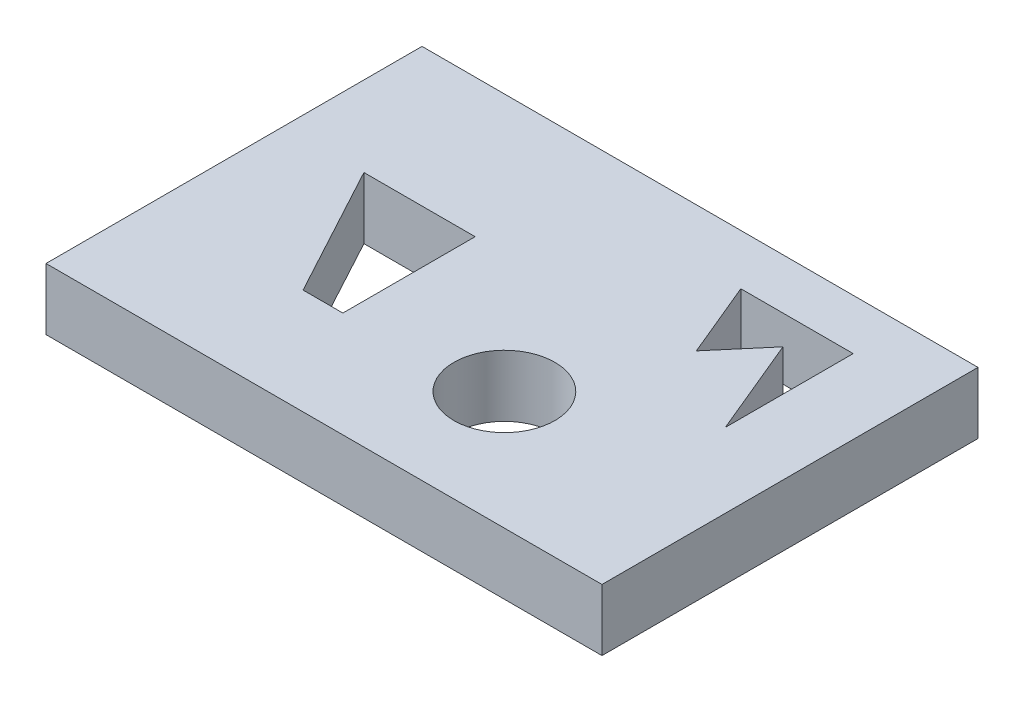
ISO-10303-21;
HEADER;
FILE_DESCRIPTION(('STEP AP214'),'2;1');
FILE_NAME('part.step','',(''),(''),'','','');
FILE_SCHEMA(('AUTOMOTIVE_DESIGN { 1 0 10303 214 1 1 1 1 }'));
ENDSEC;
DATA;
#1=APPLICATION_CONTEXT('core data for automotive mechanical design processes');
#2=APPLICATION_PROTOCOL_DEFINITION('international standard','automotive_design',2000,#1);
#3=PRODUCT_CONTEXT('',#1,'mechanical');
#4=PRODUCT('Part','Part','',(#3));
#5=PRODUCT_RELATED_PRODUCT_CATEGORY('part','',(#4));
#6=PRODUCT_DEFINITION_FORMATION('','',#4);
#7=PRODUCT_DEFINITION_CONTEXT('part definition',#1,'design');
#8=PRODUCT_DEFINITION('design','',#6,#7);
#9=PRODUCT_DEFINITION_SHAPE('','',#8);
#10=(LENGTH_UNIT() NAMED_UNIT(*) SI_UNIT(.MILLI.,.METRE.));
#11=(NAMED_UNIT(*) PLANE_ANGLE_UNIT() SI_UNIT($,.RADIAN.));
#12=(NAMED_UNIT(*) SI_UNIT($,.STERADIAN.) SOLID_ANGLE_UNIT());
#13=UNCERTAINTY_MEASURE_WITH_UNIT(LENGTH_MEASURE(1.E-05),#10,'distance_accuracy_value','');
#14=(GEOMETRIC_REPRESENTATION_CONTEXT(3) GLOBAL_UNCERTAINTY_ASSIGNED_CONTEXT((#13)) GLOBAL_UNIT_ASSIGNED_CONTEXT((#10,
#11,#12)) REPRESENTATION_CONTEXT('',''));
#15=CARTESIAN_POINT('',(0.,0.,0.));
#16=DIRECTION('',(0.,0.,1.));
#17=DIRECTION('',(1.,0.,0.));
#18=AXIS2_PLACEMENT_3D('',#15,#16,#17);
#19=CARTESIAN_POINT('',(-105.477577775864,-24.384,-74.1902678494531));
#20=DIRECTION('',(-1.,0.,0.));
#21=DIRECTION('',(0.,0.,1.));
#22=AXIS2_PLACEMENT_3D('',#19,#20,#21);
#23=PLANE('',#22);
#24=DIRECTION('',(0.,0.,1.));
#25=VECTOR('',#24,1.);
#26=CARTESIAN_POINT('',(-105.477577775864,0.,-74.1902678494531));
#27=LINE('',#26,#25);
#28=CARTESIAN_POINT('',(-105.477577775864,0.,-74.1902678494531));
#29=VERTEX_POINT('',#28);
#30=CARTESIAN_POINT('',(-105.477577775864,0.,74.5649661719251));
#31=VERTEX_POINT('',#30);
#32=EDGE_CURVE('E190',#29,#31,#27,.T.);
#33=ORIENTED_EDGE('',*,*,#32,.F.);
#34=DIRECTION('',(0.,1.,0.));
#35=VECTOR('',#34,1.);
#36=CARTESIAN_POINT('',(-105.477577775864,-24.384,-74.1902678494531));
#37=LINE('',#36,#35);
#38=CARTESIAN_POINT('',(-105.477577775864,-24.384,-74.1902678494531));
#39=VERTEX_POINT('',#38);
#40=EDGE_CURVE('E11',#39,#29,#37,.T.);
#41=ORIENTED_EDGE('',*,*,#40,.F.);
#42=DIRECTION('',(0.,0.,1.));
#43=VECTOR('',#42,1.);
#44=CARTESIAN_POINT('',(-105.477577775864,-24.384,-74.1902678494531));
#45=LINE('',#44,#43);
#46=CARTESIAN_POINT('',(-105.477577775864,-24.384,74.5649661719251));
#47=VERTEX_POINT('',#46);
#48=EDGE_CURVE('E210',#39,#47,#45,.T.);
#49=ORIENTED_EDGE('',*,*,#48,.T.);
#50=DIRECTION('',(0.,1.,0.));
#51=VECTOR('',#50,1.);
#52=CARTESIAN_POINT('',(-105.477577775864,-24.384,74.5649661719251));
#53=LINE('',#52,#51);
#54=EDGE_CURVE('E30',#47,#31,#53,.T.);
#55=ORIENTED_EDGE('',*,*,#54,.T.);
#56=EDGE_LOOP('',(#33,#41,#49,#55));
#57=FACE_BOUND('',#56,.T.);
#58=ADVANCED_FACE('F27',(#57),#23,.T.);
#59=CARTESIAN_POINT('',(-105.477577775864,-24.384,-74.1902678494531));
#60=DIRECTION('',(0.,0.,-1.));
#61=DIRECTION('',(-1.,0.,0.));
#62=AXIS2_PLACEMENT_3D('',#59,#60,#61);
#63=PLANE('',#62);
#64=DIRECTION('',(-1.,0.,0.));
#65=VECTOR('',#64,1.);
#66=CARTESIAN_POINT('',(-105.477577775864,0.,-74.1902678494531));
#67=LINE('',#66,#65);
#68=CARTESIAN_POINT('',(114.470337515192,0.,-74.1902678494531));
#69=VERTEX_POINT('',#68);
#70=EDGE_CURVE('E207',#69,#29,#67,.T.);
#71=ORIENTED_EDGE('',*,*,#70,.F.);
#72=DIRECTION('',(0.,1.,0.));
#73=VECTOR('',#72,1.);
#74=CARTESIAN_POINT('',(114.470337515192,-24.384,-74.1902678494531));
#75=LINE('',#74,#73);
#76=CARTESIAN_POINT('',(114.470337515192,-24.384,-74.1902678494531));
#77=VERTEX_POINT('',#76);
#78=EDGE_CURVE('E35',#77,#69,#75,.T.);
#79=ORIENTED_EDGE('',*,*,#78,.F.);
#80=DIRECTION('',(-1.,0.,0.));
#81=VECTOR('',#80,1.);
#82=CARTESIAN_POINT('',(-105.477577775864,-24.384,-74.1902678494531));
#83=LINE('',#82,#81);
#84=EDGE_CURVE('E219',#77,#39,#83,.T.);
#85=ORIENTED_EDGE('',*,*,#84,.T.);
#86=ORIENTED_EDGE('',*,*,#40,.T.);
#87=EDGE_LOOP('',(#71,#79,#85,#86));
#88=FACE_BOUND('',#87,.T.);
#89=ADVANCED_FACE('F234',(#88),#63,.T.);
#90=CARTESIAN_POINT('',(114.470337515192,-24.384,-74.1902678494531));
#91=DIRECTION('',(1.,0.,0.));
#92=DIRECTION('',(0.,0.,-1.));
#93=AXIS2_PLACEMENT_3D('',#90,#91,#92);
#94=PLANE('',#93);
#95=DIRECTION('',(0.,0.,-1.));
#96=VECTOR('',#95,1.);
#97=CARTESIAN_POINT('',(114.470337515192,0.,-74.1902678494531));
#98=LINE('',#97,#96);
#99=CARTESIAN_POINT('',(114.470337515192,0.,74.5649661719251));
#100=VERTEX_POINT('',#99);
#101=EDGE_CURVE('E204',#100,#69,#98,.T.);
#102=ORIENTED_EDGE('',*,*,#101,.F.);
#103=DIRECTION('',(0.,1.,0.));
#104=VECTOR('',#103,1.);
#105=CARTESIAN_POINT('',(114.470337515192,-24.384,74.5649661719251));
#106=LINE('',#105,#104);
#107=CARTESIAN_POINT('',(114.470337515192,-24.384,74.5649661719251));
#108=VERTEX_POINT('',#107);
#109=EDGE_CURVE('E222',#108,#100,#106,.T.);
#110=ORIENTED_EDGE('',*,*,#109,.F.);
#111=DIRECTION('',(0.,0.,-1.));
#112=VECTOR('',#111,1.);
#113=CARTESIAN_POINT('',(114.470337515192,-24.384,-74.1902678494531));
#114=LINE('',#113,#112);
#115=EDGE_CURVE('E216',#108,#77,#114,.T.);
#116=ORIENTED_EDGE('',*,*,#115,.T.);
#117=ORIENTED_EDGE('',*,*,#78,.T.);
#118=EDGE_LOOP('',(#102,#110,#116,#117));
#119=FACE_BOUND('',#118,.T.);
#120=ADVANCED_FACE('F240',(#119),#94,.T.);
#121=CARTESIAN_POINT('',(-105.477577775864,-24.384,74.5649661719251));
#122=DIRECTION('',(0.,0.,1.));
#123=DIRECTION('',(1.,0.,0.));
#124=AXIS2_PLACEMENT_3D('',#121,#122,#123);
#125=PLANE('',#124);
#126=DIRECTION('',(1.,0.,0.));
#127=VECTOR('',#126,1.);
#128=CARTESIAN_POINT('',(-105.477577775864,0.,74.5649661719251));
#129=LINE('',#128,#127);
#130=EDGE_CURVE('E201',#31,#100,#129,.T.);
#131=ORIENTED_EDGE('',*,*,#130,.F.);
#132=ORIENTED_EDGE('',*,*,#54,.F.);
#133=DIRECTION('',(1.,0.,0.));
#134=VECTOR('',#133,1.);
#135=CARTESIAN_POINT('',(-105.477577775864,-24.384,74.5649661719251));
#136=LINE('',#135,#134);
#137=EDGE_CURVE('E213',#47,#108,#136,.T.);
#138=ORIENTED_EDGE('',*,*,#137,.T.);
#139=ORIENTED_EDGE('',*,*,#109,.T.);
#140=EDGE_LOOP('',(#131,#132,#138,#139));
#141=FACE_BOUND('',#140,.T.);
#142=ADVANCED_FACE('F230',(#141),#125,.T.);
#143=CARTESIAN_POINT('',(-105.477577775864,-24.384,74.5649661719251));
#144=DIRECTION('',(0.,1.,0.));
#145=DIRECTION('',(0.,0.,1.));
#146=AXIS2_PLACEMENT_3D('',#143,#144,#145);
#147=PLANE('',#146);
#148=CARTESIAN_POINT('',(29.0381715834,-24.384,27.7389832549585));
#149=DIRECTION('',(0.,1.,0.));
#150=DIRECTION('',(0.,0.,1.));
#151=AXIS2_PLACEMENT_3D('',#148,#149,#150);
#152=CIRCLE('',#151,19.9757724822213);
#153=CARTESIAN_POINT('',(29.0381715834,-24.384,47.7147557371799));
#154=VERTEX_POINT('',#153);
#155=EDGE_CURVE('E355',#154,#154,#152,.T.);
#156=ORIENTED_EDGE('',*,*,#155,.T.);
#157=EDGE_LOOP('',(#156));
#158=FACE_BOUND('',#157,.T.);
#159=DIRECTION('',(0.,0.,-1.));
#160=VECTOR('',#159,1.);
#161=CARTESIAN_POINT('',(-29.7695179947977,-24.384,-19.4923894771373));
#162=LINE('',#161,#160);
#163=CARTESIAN_POINT('',(-29.7695179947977,-24.384,32.8325626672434));
#164=VERTEX_POINT('',#163);
#165=CARTESIAN_POINT('',(-29.7695179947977,-24.384,-19.4923894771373));
#166=VERTEX_POINT('',#165);
#167=EDGE_CURVE('E151',#164,#166,#162,.T.);
#168=ORIENTED_EDGE('',*,*,#167,.T.);
#169=DIRECTION('',(-1.,0.,0.));
#170=VECTOR('',#169,1.);
#171=CARTESIAN_POINT('',(-73.759522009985,-24.384,-19.4923894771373));
#172=LINE('',#171,#170);
#173=CARTESIAN_POINT('',(-73.759522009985,-24.384,-19.4923894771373));
#174=VERTEX_POINT('',#173);
#175=EDGE_CURVE('E142',#166,#174,#172,.T.);
#176=ORIENTED_EDGE('',*,*,#175,.T.);
#177=DIRECTION('',(0.475028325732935,0.,0.879970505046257));
#178=VECTOR('',#177,1.);
#179=CARTESIAN_POINT('',(-45.5133089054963,-24.384,32.8325626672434));
#180=LINE('',#179,#178);
#181=CARTESIAN_POINT('',(-45.5133089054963,-24.384,32.8325626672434));
#182=VERTEX_POINT('',#181);
#183=EDGE_CURVE('E148',#174,#182,#180,.T.);
#184=ORIENTED_EDGE('',*,*,#183,.T.);
#185=DIRECTION('',(1.,0.,0.));
#186=VECTOR('',#185,1.);
#187=CARTESIAN_POINT('',(-29.7695179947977,-24.384,32.8325626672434));
#188=LINE('',#187,#186);
#189=EDGE_CURVE('E43',#182,#164,#188,.T.);
#190=ORIENTED_EDGE('',*,*,#189,.T.);
#191=EDGE_LOOP('',(#168,#176,#184,#190));
#192=FACE_BOUND('',#191,.T.);
#193=DIRECTION('',(0.383606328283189,0.,0.923496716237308));
#194=VECTOR('',#193,1.);
#195=CARTESIAN_POINT('',(68.8607015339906,-24.384,-42.6450231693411));
#196=LINE('',#195,#194);
#197=CARTESIAN_POINT('',(68.8607015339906,-24.384,-42.6450231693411));
#198=VERTEX_POINT('',#197);
#199=CARTESIAN_POINT('',(85.0675451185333,-24.384,-3.62854787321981));
#200=VERTEX_POINT('',#199);
#201=EDGE_CURVE('E184',#198,#200,#196,.T.);
#202=ORIENTED_EDGE('',*,*,#201,.T.);
#203=DIRECTION('',(0.,0.,-1.));
#204=VECTOR('',#203,1.);
#205=CARTESIAN_POINT('',(85.0675451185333,-24.384,-3.62854787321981));
#206=LINE('',#205,#204);
#207=CARTESIAN_POINT('',(85.0675451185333,-24.384,-54.2213400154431));
#208=VERTEX_POINT('',#207);
#209=EDGE_CURVE('E172',#200,#208,#206,.T.);
#210=ORIENTED_EDGE('',*,*,#209,.T.);
#211=DIRECTION('',(-1.,0.,0.));
#212=VECTOR('',#211,1.);
#213=CARTESIAN_POINT('',(85.0675451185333,-24.384,-54.2213400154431));
#214=LINE('',#213,#212);
#215=CARTESIAN_POINT('',(40.6144884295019,-24.384,-54.2213400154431));
#216=VERTEX_POINT('',#215);
#217=EDGE_CURVE('E175',#208,#216,#214,.T.);
#218=ORIENTED_EDGE('',*,*,#217,.T.);
#219=DIRECTION('',(0.383606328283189,0.,0.923496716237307));
#220=VECTOR('',#219,1.);
#221=CARTESIAN_POINT('',(40.6144884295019,-24.384,-54.2213400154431));
#222=LINE('',#221,#220);
#223=CARTESIAN_POINT('',(53.116910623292,-24.384,-24.1229162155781));
#224=VERTEX_POINT('',#223);
#225=EDGE_CURVE('E178',#216,#224,#222,.T.);
#226=ORIENTED_EDGE('',*,*,#225,.T.);
#227=DIRECTION('',(0.64764842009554,0.,-0.761939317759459));
#228=VECTOR('',#227,1.);
#229=CARTESIAN_POINT('',(53.116910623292,-24.384,-24.1229162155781));
#230=LINE('',#229,#228);
#231=EDGE_CURVE('E181',#224,#198,#230,.T.);
#232=ORIENTED_EDGE('',*,*,#231,.T.);
#233=EDGE_LOOP('',(#202,#210,#218,#226,#232));
#234=FACE_BOUND('',#233,.T.);
#235=ORIENTED_EDGE('',*,*,#48,.F.);
#236=ORIENTED_EDGE('',*,*,#84,.F.);
#237=ORIENTED_EDGE('',*,*,#115,.F.);
#238=ORIENTED_EDGE('',*,*,#137,.F.);
#239=EDGE_LOOP('',(#235,#236,#237,#238));
#240=FACE_BOUND('',#239,.T.);
#241=ADVANCED_FACE('F237',(#158,#192,#234,#240),#147,.F.);
#242=CARTESIAN_POINT('',(-105.477577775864,0.,74.5649661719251));
#243=DIRECTION('',(0.,1.,0.));
#244=DIRECTION('',(0.,0.,1.));
#245=AXIS2_PLACEMENT_3D('',#242,#243,#244);
#246=PLANE('',#245);
#247=CARTESIAN_POINT('',(29.0381715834,0.,27.7389832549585));
#248=DIRECTION('',(0.,1.,0.));
#249=DIRECTION('',(0.,0.,1.));
#250=AXIS2_PLACEMENT_3D('',#247,#248,#249);
#251=CIRCLE('',#250,19.9757724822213);
#252=CARTESIAN_POINT('',(29.0381715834,0.,47.7147557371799));
#253=VERTEX_POINT('',#252);
#254=EDGE_CURVE('E358',#253,#253,#251,.T.);
#255=ORIENTED_EDGE('',*,*,#254,.F.);
#256=EDGE_LOOP('',(#255));
#257=FACE_BOUND('',#256,.T.);
#258=DIRECTION('',(-1.,0.,0.));
#259=VECTOR('',#258,1.);
#260=CARTESIAN_POINT('',(-73.759522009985,0.,-19.4923894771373));
#261=LINE('',#260,#259);
#262=CARTESIAN_POINT('',(-29.7695179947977,0.,-19.4923894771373));
#263=VERTEX_POINT('',#262);
#264=CARTESIAN_POINT('',(-73.759522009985,0.,-19.4923894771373));
#265=VERTEX_POINT('',#264);
#266=EDGE_CURVE('E51',#263,#265,#261,.T.);
#267=ORIENTED_EDGE('',*,*,#266,.F.);
#268=DIRECTION('',(0.,0.,-1.));
#269=VECTOR('',#268,1.);
#270=CARTESIAN_POINT('',(-29.7695179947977,0.,-19.4923894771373));
#271=LINE('',#270,#269);
#272=CARTESIAN_POINT('',(-29.7695179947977,0.,32.8325626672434));
#273=VERTEX_POINT('',#272);
#274=EDGE_CURVE('E140',#273,#263,#271,.T.);
#275=ORIENTED_EDGE('',*,*,#274,.F.);
#276=DIRECTION('',(1.,0.,0.));
#277=VECTOR('',#276,1.);
#278=CARTESIAN_POINT('',(-29.7695179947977,0.,32.8325626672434));
#279=LINE('',#278,#277);
#280=CARTESIAN_POINT('',(-45.5133089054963,0.,32.8325626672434));
#281=VERTEX_POINT('',#280);
#282=EDGE_CURVE('E124',#281,#273,#279,.T.);
#283=ORIENTED_EDGE('',*,*,#282,.F.);
#284=DIRECTION('',(0.475028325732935,0.,0.879970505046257));
#285=VECTOR('',#284,1.);
#286=CARTESIAN_POINT('',(-45.5133089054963,0.,32.8325626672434));
#287=LINE('',#286,#285);
#288=EDGE_CURVE('E133',#265,#281,#287,.T.);
#289=ORIENTED_EDGE('',*,*,#288,.F.);
#290=EDGE_LOOP('',(#267,#275,#283,#289));
#291=FACE_BOUND('',#290,.T.);
#292=DIRECTION('',(0.,0.,-1.));
#293=VECTOR('',#292,1.);
#294=CARTESIAN_POINT('',(85.0675451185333,0.,-3.62854787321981));
#295=LINE('',#294,#293);
#296=CARTESIAN_POINT('',(85.0675451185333,0.,-3.62854787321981));
#297=VERTEX_POINT('',#296);
#298=CARTESIAN_POINT('',(85.0675451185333,0.,-54.2213400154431));
#299=VERTEX_POINT('',#298);
#300=EDGE_CURVE('E156',#297,#299,#295,.T.);
#301=ORIENTED_EDGE('',*,*,#300,.F.);
#302=DIRECTION('',(0.383606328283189,0.,0.923496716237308));
#303=VECTOR('',#302,1.);
#304=CARTESIAN_POINT('',(68.8607015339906,0.,-42.6450231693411));
#305=LINE('',#304,#303);
#306=CARTESIAN_POINT('',(68.8607015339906,0.,-42.6450231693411));
#307=VERTEX_POINT('',#306);
#308=EDGE_CURVE('E169',#307,#297,#305,.T.);
#309=ORIENTED_EDGE('',*,*,#308,.F.);
#310=DIRECTION('',(0.64764842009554,0.,-0.761939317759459));
#311=VECTOR('',#310,1.);
#312=CARTESIAN_POINT('',(53.116910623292,0.,-24.1229162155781));
#313=LINE('',#312,#311);
#314=CARTESIAN_POINT('',(53.116910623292,0.,-24.1229162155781));
#315=VERTEX_POINT('',#314);
#316=EDGE_CURVE('E166',#315,#307,#313,.T.);
#317=ORIENTED_EDGE('',*,*,#316,.F.);
#318=DIRECTION('',(0.383606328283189,0.,0.923496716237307));
#319=VECTOR('',#318,1.);
#320=CARTESIAN_POINT('',(40.6144884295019,0.,-54.2213400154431));
#321=LINE('',#320,#319);
#322=CARTESIAN_POINT('',(40.6144884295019,0.,-54.2213400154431));
#323=VERTEX_POINT('',#322);
#324=EDGE_CURVE('E163',#323,#315,#321,.T.);
#325=ORIENTED_EDGE('',*,*,#324,.F.);
#326=DIRECTION('',(-1.,0.,0.));
#327=VECTOR('',#326,1.);
#328=CARTESIAN_POINT('',(85.0675451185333,0.,-54.2213400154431));
#329=LINE('',#328,#327);
#330=EDGE_CURVE('E160',#299,#323,#329,.T.);
#331=ORIENTED_EDGE('',*,*,#330,.F.);
#332=EDGE_LOOP('',(#301,#309,#317,#325,#331));
#333=FACE_BOUND('',#332,.T.);
#334=ORIENTED_EDGE('',*,*,#32,.T.);
#335=ORIENTED_EDGE('',*,*,#130,.T.);
#336=ORIENTED_EDGE('',*,*,#101,.T.);
#337=ORIENTED_EDGE('',*,*,#70,.T.);
#338=EDGE_LOOP('',(#334,#335,#336,#337));
#339=FACE_BOUND('',#338,.T.);
#340=ADVANCED_FACE('F137',(#257,#291,#333,#339),#246,.T.);
#341=CARTESIAN_POINT('',(85.0675451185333,-24.384,-3.62854787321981));
#342=DIRECTION('',(1.,0.,0.));
#343=DIRECTION('',(0.,0.,-1.));
#344=AXIS2_PLACEMENT_3D('',#341,#342,#343);
#345=PLANE('',#344);
#346=ORIENTED_EDGE('',*,*,#300,.T.);
#347=DIRECTION('',(0.,1.,0.));
#348=VECTOR('',#347,1.);
#349=CARTESIAN_POINT('',(85.0675451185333,-24.384,-54.2213400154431));
#350=LINE('',#349,#348);
#351=EDGE_CURVE('E187',#208,#299,#350,.T.);
#352=ORIENTED_EDGE('',*,*,#351,.F.);
#353=ORIENTED_EDGE('',*,*,#209,.F.);
#354=DIRECTION('',(0.,1.,0.));
#355=VECTOR('',#354,1.);
#356=CARTESIAN_POINT('',(85.0675451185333,-24.384,-3.62854787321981));
#357=LINE('',#356,#355);
#358=EDGE_CURVE('E188',#200,#297,#357,.T.);
#359=ORIENTED_EDGE('',*,*,#358,.T.);
#360=EDGE_LOOP('',(#346,#352,#353,#359));
#361=FACE_BOUND('',#360,.T.);
#362=ADVANCED_FACE('F275',(#361),#345,.F.);
#363=CARTESIAN_POINT('',(68.8607015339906,-24.384,-42.6450231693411));
#364=DIRECTION('',(-0.923496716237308,0.,0.383606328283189));
#365=DIRECTION('',(0.383606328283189,0.,0.923496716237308));
#366=AXIS2_PLACEMENT_3D('',#363,#364,#365);
#367=PLANE('',#366);
#368=ORIENTED_EDGE('',*,*,#308,.T.);
#369=ORIENTED_EDGE('',*,*,#358,.F.);
#370=ORIENTED_EDGE('',*,*,#201,.F.);
#371=DIRECTION('',(0.,1.,0.));
#372=VECTOR('',#371,1.);
#373=CARTESIAN_POINT('',(68.8607015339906,-24.384,-42.6450231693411));
#374=LINE('',#373,#372);
#375=EDGE_CURVE('E191',#198,#307,#374,.T.);
#376=ORIENTED_EDGE('',*,*,#375,.T.);
#377=EDGE_LOOP('',(#368,#369,#370,#376));
#378=FACE_BOUND('',#377,.T.);
#379=ADVANCED_FACE('F283',(#378),#367,.F.);
#380=CARTESIAN_POINT('',(53.116910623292,-24.384,-24.1229162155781));
#381=DIRECTION('',(0.761939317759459,0.,0.64764842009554));
#382=DIRECTION('',(0.64764842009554,0.,-0.761939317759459));
#383=AXIS2_PLACEMENT_3D('',#380,#381,#382);
#384=PLANE('',#383);
#385=ORIENTED_EDGE('',*,*,#316,.T.);
#386=ORIENTED_EDGE('',*,*,#375,.F.);
#387=ORIENTED_EDGE('',*,*,#231,.F.);
#388=DIRECTION('',(0.,1.,0.));
#389=VECTOR('',#388,1.);
#390=CARTESIAN_POINT('',(53.116910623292,-24.384,-24.1229162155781));
#391=LINE('',#390,#389);
#392=EDGE_CURVE('E193',#224,#315,#391,.T.);
#393=ORIENTED_EDGE('',*,*,#392,.T.);
#394=EDGE_LOOP('',(#385,#386,#387,#393));
#395=FACE_BOUND('',#394,.T.);
#396=ADVANCED_FACE('F291',(#395),#384,.F.);
#397=CARTESIAN_POINT('',(40.6144884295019,-24.384,-54.2213400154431));
#398=DIRECTION('',(-0.923496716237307,0.,0.383606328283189));
#399=DIRECTION('',(0.383606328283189,0.,0.923496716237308));
#400=AXIS2_PLACEMENT_3D('',#397,#398,#399);
#401=PLANE('',#400);
#402=ORIENTED_EDGE('',*,*,#324,.T.);
#403=ORIENTED_EDGE('',*,*,#392,.F.);
#404=ORIENTED_EDGE('',*,*,#225,.F.);
#405=DIRECTION('',(0.,1.,0.));
#406=VECTOR('',#405,1.);
#407=CARTESIAN_POINT('',(40.6144884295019,-24.384,-54.2213400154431));
#408=LINE('',#407,#406);
#409=EDGE_CURVE('E195',#216,#323,#408,.T.);
#410=ORIENTED_EDGE('',*,*,#409,.T.);
#411=EDGE_LOOP('',(#402,#403,#404,#410));
#412=FACE_BOUND('',#411,.T.);
#413=ADVANCED_FACE('F299',(#412),#401,.F.);
#414=CARTESIAN_POINT('',(85.0675451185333,-24.384,-54.2213400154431));
#415=DIRECTION('',(0.,0.,-1.));
#416=DIRECTION('',(-1.,0.,0.));
#417=AXIS2_PLACEMENT_3D('',#414,#415,#416);
#418=PLANE('',#417);
#419=ORIENTED_EDGE('',*,*,#330,.T.);
#420=ORIENTED_EDGE('',*,*,#409,.F.);
#421=ORIENTED_EDGE('',*,*,#217,.F.);
#422=ORIENTED_EDGE('',*,*,#351,.T.);
#423=EDGE_LOOP('',(#419,#420,#421,#422));
#424=FACE_BOUND('',#423,.T.);
#425=ADVANCED_FACE('F307',(#424),#418,.F.);
#426=CARTESIAN_POINT('',(-73.759522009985,-24.384,-19.4923894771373));
#427=DIRECTION('',(0.,0.,-1.));
#428=DIRECTION('',(-1.,0.,0.));
#429=AXIS2_PLACEMENT_3D('',#426,#427,#428);
#430=PLANE('',#429);
#431=ORIENTED_EDGE('',*,*,#266,.T.);
#432=DIRECTION('',(0.,1.,0.));
#433=VECTOR('',#432,1.);
#434=CARTESIAN_POINT('',(-73.759522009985,-24.384,-19.4923894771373));
#435=LINE('',#434,#433);
#436=EDGE_CURVE('E130',#174,#265,#435,.T.);
#437=ORIENTED_EDGE('',*,*,#436,.F.);
#438=ORIENTED_EDGE('',*,*,#175,.F.);
#439=DIRECTION('',(0.,1.,0.));
#440=VECTOR('',#439,1.);
#441=CARTESIAN_POINT('',(-29.7695179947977,-24.384,-19.4923894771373));
#442=LINE('',#441,#440);
#443=EDGE_CURVE('E154',#166,#263,#442,.T.);
#444=ORIENTED_EDGE('',*,*,#443,.T.);
#445=EDGE_LOOP('',(#431,#437,#438,#444));
#446=FACE_BOUND('',#445,.T.);
#447=ADVANCED_FACE('F315',(#446),#430,.F.);
#448=CARTESIAN_POINT('',(-29.7695179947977,-24.384,-19.4923894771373));
#449=DIRECTION('',(1.,0.,0.));
#450=DIRECTION('',(0.,0.,-1.));
#451=AXIS2_PLACEMENT_3D('',#448,#449,#450);
#452=PLANE('',#451);
#453=ORIENTED_EDGE('',*,*,#274,.T.);
#454=ORIENTED_EDGE('',*,*,#443,.F.);
#455=ORIENTED_EDGE('',*,*,#167,.F.);
#456=DIRECTION('',(0.,1.,0.));
#457=VECTOR('',#456,1.);
#458=CARTESIAN_POINT('',(-29.7695179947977,-24.384,32.8325626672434));
#459=LINE('',#458,#457);
#460=EDGE_CURVE('E129',#164,#273,#459,.T.);
#461=ORIENTED_EDGE('',*,*,#460,.T.);
#462=EDGE_LOOP('',(#453,#454,#455,#461));
#463=FACE_BOUND('',#462,.T.);
#464=ADVANCED_FACE('F323',(#463),#452,.F.);
#465=CARTESIAN_POINT('',(-29.7695179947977,-24.384,32.8325626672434));
#466=DIRECTION('',(0.,0.,1.));
#467=DIRECTION('',(1.,0.,0.));
#468=AXIS2_PLACEMENT_3D('',#465,#466,#467);
#469=PLANE('',#468);
#470=ORIENTED_EDGE('',*,*,#282,.T.);
#471=ORIENTED_EDGE('',*,*,#460,.F.);
#472=ORIENTED_EDGE('',*,*,#189,.F.);
#473=DIRECTION('',(0.,1.,0.));
#474=VECTOR('',#473,1.);
#475=CARTESIAN_POINT('',(-45.5133089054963,-24.384,32.8325626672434));
#476=LINE('',#475,#474);
#477=EDGE_CURVE('E120',#182,#281,#476,.T.);
#478=ORIENTED_EDGE('',*,*,#477,.T.);
#479=EDGE_LOOP('',(#470,#471,#472,#478));
#480=FACE_BOUND('',#479,.T.);
#481=ADVANCED_FACE('F122',(#480),#469,.F.);
#482=CARTESIAN_POINT('',(-45.5133089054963,-24.384,32.8325626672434));
#483=DIRECTION('',(-0.879970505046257,0.,0.475028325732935));
#484=DIRECTION('',(0.475028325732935,0.,0.879970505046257));
#485=AXIS2_PLACEMENT_3D('',#482,#483,#484);
#486=PLANE('',#485);
#487=ORIENTED_EDGE('',*,*,#288,.T.);
#488=ORIENTED_EDGE('',*,*,#477,.F.);
#489=ORIENTED_EDGE('',*,*,#183,.F.);
#490=ORIENTED_EDGE('',*,*,#436,.T.);
#491=EDGE_LOOP('',(#487,#488,#489,#490));
#492=FACE_BOUND('',#491,.T.);
#493=ADVANCED_FACE('F134',(#492),#486,.F.);
#494=CARTESIAN_POINT('',(29.0381715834,-24.384,27.7389832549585));
#495=DIRECTION('',(0.,1.,0.));
#496=DIRECTION('',(0.,0.,1.));
#497=AXIS2_PLACEMENT_3D('',#494,#495,#496);
#498=CYLINDRICAL_SURFACE('',#497,19.9757724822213);
#499=CARTESIAN_POINT('',(29.0381715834,-24.384,47.7147557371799));
#500=CARTESIAN_POINT('',(29.0381715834,-24.13,47.7147557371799));
#501=CARTESIAN_POINT('',(29.0381715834,-23.876,47.7147557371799));
#502=CARTESIAN_POINT('',(29.0381715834,-23.368,47.7147557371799));
#503=CARTESIAN_POINT('',(29.0381715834,-23.114,47.7147557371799));
#504=CARTESIAN_POINT('',(29.0381715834,-22.606,47.7147557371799));
#505=CARTESIAN_POINT('',(29.0381715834,-22.352,47.7147557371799));
#506=CARTESIAN_POINT('',(29.0381715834,-21.844,47.7147557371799));
#507=CARTESIAN_POINT('',(29.0381715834,-21.59,47.7147557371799));
#508=CARTESIAN_POINT('',(29.0381715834,-21.082,47.7147557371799));
#509=CARTESIAN_POINT('',(29.0381715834,-20.828,47.7147557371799));
#510=CARTESIAN_POINT('',(29.0381715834,-20.32,47.7147557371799));
#511=CARTESIAN_POINT('',(29.0381715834,-20.066,47.7147557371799));
#512=CARTESIAN_POINT('',(29.0381715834,-19.558,47.7147557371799));
#513=CARTESIAN_POINT('',(29.0381715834,-19.304,47.7147557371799));
#514=CARTESIAN_POINT('',(29.0381715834,-18.796,47.7147557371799));
#515=CARTESIAN_POINT('',(29.0381715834,-18.542,47.7147557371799));
#516=CARTESIAN_POINT('',(29.0381715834,-18.034,47.7147557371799));
#517=CARTESIAN_POINT('',(29.0381715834,-17.78,47.7147557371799));
#518=CARTESIAN_POINT('',(29.0381715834,-17.272,47.7147557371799));
#519=CARTESIAN_POINT('',(29.0381715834,-17.018,47.7147557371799));
#520=CARTESIAN_POINT('',(29.0381715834,-16.51,47.7147557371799));
#521=CARTESIAN_POINT('',(29.0381715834,-16.256,47.7147557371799));
#522=CARTESIAN_POINT('',(29.0381715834,-15.748,47.7147557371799));
#523=CARTESIAN_POINT('',(29.0381715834,-15.494,47.7147557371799));
#524=CARTESIAN_POINT('',(29.0381715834,-14.986,47.7147557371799));
#525=CARTESIAN_POINT('',(29.0381715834,-14.732,47.7147557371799));
#526=CARTESIAN_POINT('',(29.0381715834,-14.224,47.7147557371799));
#527=CARTESIAN_POINT('',(29.0381715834,-13.97,47.7147557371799));
#528=CARTESIAN_POINT('',(29.0381715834,-13.462,47.7147557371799));
#529=CARTESIAN_POINT('',(29.0381715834,-13.208,47.7147557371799));
#530=CARTESIAN_POINT('',(29.0381715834,-12.7,47.7147557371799));
#531=CARTESIAN_POINT('',(29.0381715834,-12.446,47.7147557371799));
#532=CARTESIAN_POINT('',(29.0381715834,-11.938,47.7147557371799));
#533=CARTESIAN_POINT('',(29.0381715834,-11.684,47.7147557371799));
#534=CARTESIAN_POINT('',(29.0381715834,-11.176,47.7147557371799));
#535=CARTESIAN_POINT('',(29.0381715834,-10.922,47.7147557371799));
#536=CARTESIAN_POINT('',(29.0381715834,-10.414,47.7147557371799));
#537=CARTESIAN_POINT('',(29.0381715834,-10.16,47.7147557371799));
#538=CARTESIAN_POINT('',(29.0381715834,-9.652,47.7147557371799));
#539=CARTESIAN_POINT('',(29.0381715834,-9.398,47.7147557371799));
#540=CARTESIAN_POINT('',(29.0381715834,-8.89,47.7147557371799));
#541=CARTESIAN_POINT('',(29.0381715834,-8.636,47.7147557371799));
#542=CARTESIAN_POINT('',(29.0381715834,-8.128,47.7147557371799));
#543=CARTESIAN_POINT('',(29.0381715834,-7.874,47.7147557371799));
#544=CARTESIAN_POINT('',(29.0381715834,-7.366,47.7147557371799));
#545=CARTESIAN_POINT('',(29.0381715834,-7.112,47.7147557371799));
#546=CARTESIAN_POINT('',(29.0381715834,-6.604,47.7147557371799));
#547=CARTESIAN_POINT('',(29.0381715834,-6.35,47.7147557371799));
#548=CARTESIAN_POINT('',(29.0381715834,-5.842,47.7147557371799));
#549=CARTESIAN_POINT('',(29.0381715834,-5.588,47.7147557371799));
#550=CARTESIAN_POINT('',(29.0381715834,-5.08,47.7147557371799));
#551=CARTESIAN_POINT('',(29.0381715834,-4.826,47.7147557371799));
#552=CARTESIAN_POINT('',(29.0381715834,-4.318,47.7147557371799));
#553=CARTESIAN_POINT('',(29.0381715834,-4.064,47.7147557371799));
#554=CARTESIAN_POINT('',(29.0381715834,-3.556,47.7147557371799));
#555=CARTESIAN_POINT('',(29.0381715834,-3.302,47.7147557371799));
#556=CARTESIAN_POINT('',(29.0381715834,-2.794,47.7147557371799));
#557=CARTESIAN_POINT('',(29.0381715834,-2.54,47.7147557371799));
#558=CARTESIAN_POINT('',(29.0381715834,-2.032,47.7147557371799));
#559=CARTESIAN_POINT('',(29.0381715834,-1.778,47.7147557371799));
#560=CARTESIAN_POINT('',(29.0381715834,-1.27,47.7147557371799));
#561=CARTESIAN_POINT('',(29.0381715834,-1.016,47.7147557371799));
#562=CARTESIAN_POINT('',(29.0381715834,-0.507999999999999,47.7147557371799));
#563=CARTESIAN_POINT('',(29.0381715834,-0.254,47.7147557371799));
#564=CARTESIAN_POINT('',(29.0381715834,0.,47.7147557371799));
#565=B_SPLINE_CURVE_WITH_KNOTS('',3,(#499,#500,#501,#502,#503,#504,#505,#506,#507,#508,#509,
#510,#511,#512,#513,#514,#515,#516,#517,#518,#519,#520,#521,#522,#523,#524,#525,#526,#527,#528,
#529,#530,#531,#532,#533,#534,#535,#536,#537,#538,#539,#540,#541,#542,#543,#544,#545,#546,#547,
#548,#549,#550,#551,#552,#553,#554,#555,#556,#557,#558,#559,#560,#561,#562,#563,#564),
.UNSPECIFIED.,.F.,.F.,(4,2,2,2,2,2,2,2,2,2,2,2,2,2,2,2,2,2,2,2,2,2,2,2,2,2,2,2,2,2,2,2,4),(0.,
0.762000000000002,1.524,2.286,3.048,3.81,4.572,5.334,6.096,6.858,7.62,8.382,9.144,9.906,10.668,
11.43,12.192,12.954,13.716,14.478,15.24,16.002,16.764,17.526,18.288,19.05,19.812,20.574,21.336,
22.098,22.86,23.622,24.384),.UNSPECIFIED.);
#566=EDGE_CURVE('BSEAM343',#154,#253,#565,.T.);
#567=ORIENTED_EDGE('',*,*,#155,.F.);
#568=ORIENTED_EDGE('',*,*,#254,.T.);
#569=ORIENTED_EDGE('',*,*,#566,.T.);
#570=ORIENTED_EDGE('',*,*,#566,.F.);
#571=EDGE_LOOP('',(#567,#569,#568,#570));
#572=FACE_BOUND('',#571,.T.);
#573=ADVANCED_FACE('F343',(#572),#498,.F.);
#574=CLOSED_SHELL('',(#58,#89,#120,#142,#241,#340,#362,#379,#396,#413,#425,#447,#464,#481,#493,#573));
#575=MANIFOLD_SOLID_BREP('B2',#574);
#576=ADVANCED_BREP_SHAPE_REPRESENTATION('',(#18,#575),#14);
#577=SHAPE_DEFINITION_REPRESENTATION(#9,#576);
ENDSEC;
END-ISO-10303-21;
